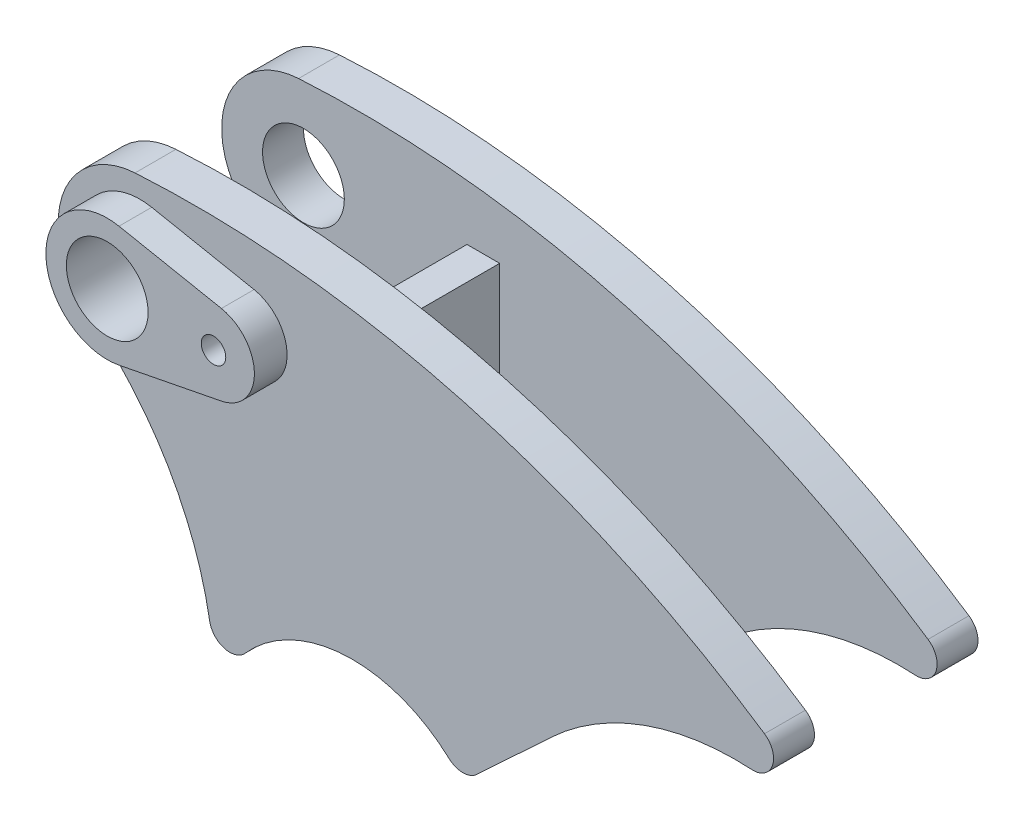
ISO-10303-21;
HEADER;
FILE_DESCRIPTION(('STEP AP214'),'2;1');
FILE_NAME('part.step','',(''),(''),'','','');
FILE_SCHEMA(('AUTOMOTIVE_DESIGN { 1 0 10303 214 1 1 1 1 }'));
ENDSEC;
DATA;
#1=APPLICATION_CONTEXT('core data for automotive mechanical design processes');
#2=APPLICATION_PROTOCOL_DEFINITION('international standard','automotive_design',2000,#1);
#3=PRODUCT_CONTEXT('',#1,'mechanical');
#4=PRODUCT('Part','Part','',(#3));
#5=PRODUCT_RELATED_PRODUCT_CATEGORY('part','',(#4));
#6=PRODUCT_DEFINITION_FORMATION('','',#4);
#7=PRODUCT_DEFINITION_CONTEXT('part definition',#1,'design');
#8=PRODUCT_DEFINITION('design','',#6,#7);
#9=PRODUCT_DEFINITION_SHAPE('','',#8);
#10=(LENGTH_UNIT() NAMED_UNIT(*) SI_UNIT(.MILLI.,.METRE.));
#11=(NAMED_UNIT(*) PLANE_ANGLE_UNIT() SI_UNIT($,.RADIAN.));
#12=(NAMED_UNIT(*) SI_UNIT($,.STERADIAN.) SOLID_ANGLE_UNIT());
#13=UNCERTAINTY_MEASURE_WITH_UNIT(LENGTH_MEASURE(1.E-05),#10,'distance_accuracy_value','');
#14=(GEOMETRIC_REPRESENTATION_CONTEXT(3) GLOBAL_UNCERTAINTY_ASSIGNED_CONTEXT((#13)) GLOBAL_UNIT_ASSIGNED_CONTEXT((#10,
#11,#12)) REPRESENTATION_CONTEXT('',''));
#15=CARTESIAN_POINT('',(0.,0.,0.));
#16=DIRECTION('',(0.,0.,1.));
#17=DIRECTION('',(1.,0.,0.));
#18=AXIS2_PLACEMENT_3D('',#15,#16,#17);
#19=CARTESIAN_POINT('',(51.9730544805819,-91.4880351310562,25.));
#20=DIRECTION('',(0.,0.,-1.));
#21=DIRECTION('',(-1.,0.,0.));
#22=AXIS2_PLACEMENT_3D('',#19,#20,#21);
#23=PLANE('',#22);
#24=CARTESIAN_POINT('',(51.9730544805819,-91.4880351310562,25.));
#25=DIRECTION('',(0.,0.,-1.));
#26=DIRECTION('',(-1.,0.,0.));
#27=AXIS2_PLACEMENT_3D('',#24,#25,#26);
#28=CIRCLE('',#27,35.);
#29=CARTESIAN_POINT('',(25.7466318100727,-68.311004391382,25.));
#30=VERTEX_POINT('',#29);
#31=CARTESIAN_POINT('',(75.6216318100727,-65.686004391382,25.));
#32=VERTEX_POINT('',#31);
#33=EDGE_CURVE('E335',#30,#32,#28,.T.);
#34=ORIENTED_EDGE('',*,*,#33,.T.);
#35=CARTESIAN_POINT('',(79.,-62.,25.));
#36=DIRECTION('',(0.,0.,1.));
#37=DIRECTION('',(1.,0.,0.));
#38=AXIS2_PLACEMENT_3D('',#35,#36,#37);
#39=CIRCLE('',#38,5.00000000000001);
#40=CARTESIAN_POINT('',(82.4099918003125,-65.6567685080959,25.));
#41=VERTEX_POINT('',#40);
#42=EDGE_CURVE('E338',#32,#41,#39,.T.);
#43=ORIENTED_EDGE('',*,*,#42,.T.);
#44=DIRECTION('',(0.731353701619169,0.6819983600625,0.));
#45=VECTOR('',#44,1.);
#46=CARTESIAN_POINT('',(82.4099918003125,-65.6567685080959,25.));
#47=LINE('',#46,#45);
#48=CARTESIAN_POINT('',(100.693834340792,-48.6068095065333,25.));
#49=VERTEX_POINT('',#48);
#50=EDGE_CURVE('E341',#41,#49,#47,.T.);
#51=ORIENTED_EDGE('',*,*,#50,.T.);
#52=CARTESIAN_POINT('',(145.705726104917,-96.8761538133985,25.));
#53=DIRECTION('',(0.,0.,-1.));
#54=DIRECTION('',(1.,0.,0.));
#55=AXIS2_PLACEMENT_3D('',#52,#53,#54);
#56=CIRCLE('',#55,66.);
#57=CARTESIAN_POINT('',(149.697586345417,-30.9969837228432,25.));
#58=VERTEX_POINT('',#57);
#59=EDGE_CURVE('E343',#49,#58,#56,.T.);
#60=ORIENTED_EDGE('',*,*,#59,.T.);
#61=CARTESIAN_POINT('',(150.,-26.0061375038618,25.));
#62=DIRECTION('',(0.,0.,1.));
#63=DIRECTION('',(1.,0.,0.));
#64=AXIS2_PLACEMENT_3D('',#61,#62,#63);
#65=CIRCLE('',#64,5.00000000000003);
#66=CARTESIAN_POINT('',(152.781650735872,-21.8513307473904,25.));
#67=VERTEX_POINT('',#66);
#68=EDGE_CURVE('E345',#58,#67,#65,.T.);
#69=ORIENTED_EDGE('',*,*,#68,.T.);
#70=CARTESIAN_POINT('',(13.6991139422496,-229.591668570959,25.));
#71=DIRECTION('',(0.,0.,1.));
#72=DIRECTION('',(-1.,0.,0.));
#73=AXIS2_PLACEMENT_3D('',#70,#71,#72);
#74=CIRCLE('',#73,250.);
#75=CARTESIAN_POINT('',(-1.19122729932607,19.964492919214,25.));
#76=VERTEX_POINT('',#75);
#77=EDGE_CURVE('E347',#67,#76,#74,.T.);
#78=ORIENTED_EDGE('',*,*,#77,.T.);
#79=CARTESIAN_POINT('',(0.,0.,25.));
#80=DIRECTION('',(0.,0.,1.));
#81=DIRECTION('',(1.,0.,0.));
#82=AXIS2_PLACEMENT_3D('',#79,#80,#81);
#83=CIRCLE('',#82,20.0000000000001);
#84=CARTESIAN_POINT('',(-12.5602355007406,-15.564076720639,25.));
#85=VERTEX_POINT('',#84);
#86=EDGE_CURVE('E349',#76,#85,#83,.T.);
#87=ORIENTED_EDGE('',*,*,#86,.T.);
#88=CARTESIAN_POINT('',(-64.6852128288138,-80.1549951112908,25.));
#89=DIRECTION('',(0.,0.,-1.));
#90=DIRECTION('',(-1.,0.,0.));
#91=AXIS2_PLACEMENT_3D('',#88,#89,#90);
#92=CIRCLE('',#91,83.);
#93=CARTESIAN_POINT('',(17.0747038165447,-65.861079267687,25.));
#94=VERTEX_POINT('',#93);
#95=EDGE_CURVE('E351',#85,#94,#92,.T.);
#96=ORIENTED_EDGE('',*,*,#95,.T.);
#97=CARTESIAN_POINT('',(22.,-65.,25.));
#98=DIRECTION('',(0.,0.,1.));
#99=DIRECTION('',(1.,0.,0.));
#100=AXIS2_PLACEMENT_3D('',#97,#98,#99);
#101=CIRCLE('',#100,5.);
#102=EDGE_CURVE('E353',#94,#30,#101,.T.);
#103=ORIENTED_EDGE('',*,*,#102,.T.);
#104=EDGE_LOOP('',(#34,#43,#51,#60,#69,#78,#87,#96,#103));
#105=FACE_BOUND('',#104,.T.);
#106=CARTESIAN_POINT('',(0.,0.,25.));
#107=DIRECTION('',(0.,0.,1.));
#108=DIRECTION('',(1.,0.,0.));
#109=AXIS2_PLACEMENT_3D('',#106,#107,#108);
#110=CIRCLE('',#109,15.);
#111=CARTESIAN_POINT('',(2.88461538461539,14.7200201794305,25.));
#112=VERTEX_POINT('',#111);
#113=CARTESIAN_POINT('',(2.88461538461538,-14.7200201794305,25.));
#114=VERTEX_POINT('',#113);
#115=EDGE_CURVE('E232',#112,#114,#110,.T.);
#116=ORIENTED_EDGE('',*,*,#115,.F.);
#117=DIRECTION('',(-0.981334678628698,0.192307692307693,0.));
#118=VECTOR('',#117,1.);
#119=CARTESIAN_POINT('',(2.88461538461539,14.7200201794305,25.));
#120=LINE('',#119,#118);
#121=CARTESIAN_POINT('',(27.9230769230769,9.81334678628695,25.));
#122=VERTEX_POINT('',#121);
#123=EDGE_CURVE('E229',#122,#112,#120,.T.);
#124=ORIENTED_EDGE('',*,*,#123,.F.);
#125=CARTESIAN_POINT('',(26.,0.,25.));
#126=DIRECTION('',(0.,0.,1.));
#127=DIRECTION('',(1.,0.,0.));
#128=AXIS2_PLACEMENT_3D('',#125,#126,#127);
#129=CIRCLE('',#128,10.);
#130=CARTESIAN_POINT('',(27.9230769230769,-9.81334678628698,25.));
#131=VERTEX_POINT('',#130);
#132=EDGE_CURVE('E59',#131,#122,#129,.T.);
#133=ORIENTED_EDGE('',*,*,#132,.F.);
#134=DIRECTION('',(0.981334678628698,0.192307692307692,0.));
#135=VECTOR('',#134,1.);
#136=CARTESIAN_POINT('',(2.88461538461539,-14.7200201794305,25.));
#137=LINE('',#136,#135);
#138=EDGE_CURVE('E54',#114,#131,#137,.T.);
#139=ORIENTED_EDGE('',*,*,#138,.F.);
#140=EDGE_LOOP('',(#116,#124,#133,#139));
#141=FACE_BOUND('',#140,.T.);
#142=ADVANCED_FACE('F39',(#105,#141),#23,.F.);
#143=CARTESIAN_POINT('',(51.9730544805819,-91.4880351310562,25.));
#144=DIRECTION('',(0.,0.,-1.));
#145=DIRECTION('',(-1.,0.,0.));
#146=AXIS2_PLACEMENT_3D('',#143,#144,#145);
#147=CYLINDRICAL_SURFACE('',#146,35.);
#148=CARTESIAN_POINT('',(51.9730544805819,-91.4880351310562,15.));
#149=DIRECTION('',(0.,0.,-1.));
#150=DIRECTION('',(-1.,0.,0.));
#151=AXIS2_PLACEMENT_3D('',#148,#149,#150);
#152=CIRCLE('',#151,35.);
#153=CARTESIAN_POINT('',(25.7466318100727,-68.311004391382,15.));
#154=VERTEX_POINT('',#153);
#155=CARTESIAN_POINT('',(75.6216318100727,-65.686004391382,15.));
#156=VERTEX_POINT('',#155);
#157=EDGE_CURVE('E334',#154,#156,#152,.T.);
#158=ORIENTED_EDGE('',*,*,#157,.T.);
#159=DIRECTION('',(0.,0.,-1.));
#160=VECTOR('',#159,1.);
#161=CARTESIAN_POINT('',(75.6216318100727,-65.686004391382,25.));
#162=LINE('',#161,#160);
#163=EDGE_CURVE('E396',#32,#156,#162,.T.);
#164=ORIENTED_EDGE('',*,*,#163,.F.);
#165=ORIENTED_EDGE('',*,*,#33,.F.);
#166=DIRECTION('',(0.,0.,-1.));
#167=VECTOR('',#166,1.);
#168=CARTESIAN_POINT('',(25.7466318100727,-68.311004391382,25.));
#169=LINE('',#168,#167);
#170=EDGE_CURVE('E355',#30,#154,#169,.T.);
#171=ORIENTED_EDGE('',*,*,#170,.T.);
#172=EDGE_LOOP('',(#158,#164,#165,#171));
#173=FACE_BOUND('',#172,.T.);
#174=ADVANCED_FACE('F41',(#173),#147,.F.);
#175=CARTESIAN_POINT('',(79.,-62.,25.));
#176=DIRECTION('',(0.,0.,-1.));
#177=DIRECTION('',(-1.,0.,0.));
#178=AXIS2_PLACEMENT_3D('',#175,#176,#177);
#179=CYLINDRICAL_SURFACE('',#178,5.00000000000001);
#180=CARTESIAN_POINT('',(79.,-62.,15.));
#181=DIRECTION('',(0.,0.,1.));
#182=DIRECTION('',(1.,0.,0.));
#183=AXIS2_PLACEMENT_3D('',#180,#181,#182);
#184=CIRCLE('',#183,5.00000000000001);
#185=CARTESIAN_POINT('',(82.4099918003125,-65.6567685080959,15.));
#186=VERTEX_POINT('',#185);
#187=EDGE_CURVE('E358',#156,#186,#184,.T.);
#188=ORIENTED_EDGE('',*,*,#187,.T.);
#189=DIRECTION('',(0.,0.,-1.));
#190=VECTOR('',#189,1.);
#191=CARTESIAN_POINT('',(82.4099918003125,-65.6567685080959,25.));
#192=LINE('',#191,#190);
#193=EDGE_CURVE('E393',#41,#186,#192,.T.);
#194=ORIENTED_EDGE('',*,*,#193,.F.);
#195=ORIENTED_EDGE('',*,*,#42,.F.);
#196=ORIENTED_EDGE('',*,*,#163,.T.);
#197=EDGE_LOOP('',(#188,#194,#195,#196));
#198=FACE_BOUND('',#197,.T.);
#199=ADVANCED_FACE('F443',(#198),#179,.T.);
#200=CARTESIAN_POINT('',(82.4099918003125,-65.6567685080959,25.));
#201=DIRECTION('',(-0.6819983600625,0.731353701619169,0.));
#202=DIRECTION('',(-0.731353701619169,-0.6819983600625,0.));
#203=AXIS2_PLACEMENT_3D('',#200,#201,#202);
#204=PLANE('',#203);
#205=DIRECTION('',(0.731353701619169,0.6819983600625,0.));
#206=VECTOR('',#205,1.);
#207=CARTESIAN_POINT('',(82.4099918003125,-65.6567685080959,15.));
#208=LINE('',#207,#206);
#209=CARTESIAN_POINT('',(100.693834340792,-48.6068095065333,15.));
#210=VERTEX_POINT('',#209);
#211=EDGE_CURVE('E360',#186,#210,#208,.T.);
#212=ORIENTED_EDGE('',*,*,#211,.T.);
#213=DIRECTION('',(0.,0.,-1.));
#214=VECTOR('',#213,1.);
#215=CARTESIAN_POINT('',(100.693834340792,-48.6068095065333,25.));
#216=LINE('',#215,#214);
#217=EDGE_CURVE('E390',#49,#210,#216,.T.);
#218=ORIENTED_EDGE('',*,*,#217,.F.);
#219=ORIENTED_EDGE('',*,*,#50,.F.);
#220=ORIENTED_EDGE('',*,*,#193,.T.);
#221=EDGE_LOOP('',(#212,#218,#219,#220));
#222=FACE_BOUND('',#221,.T.);
#223=ADVANCED_FACE('F472',(#222),#204,.F.);
#224=CARTESIAN_POINT('',(145.705726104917,-96.8761538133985,25.));
#225=DIRECTION('',(0.,0.,-1.));
#226=DIRECTION('',(-1.,0.,0.));
#227=AXIS2_PLACEMENT_3D('',#224,#225,#226);
#228=CYLINDRICAL_SURFACE('',#227,66.);
#229=CARTESIAN_POINT('',(145.705726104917,-96.8761538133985,15.));
#230=DIRECTION('',(0.,0.,-1.));
#231=DIRECTION('',(1.,0.,0.));
#232=AXIS2_PLACEMENT_3D('',#229,#230,#231);
#233=CIRCLE('',#232,66.);
#234=CARTESIAN_POINT('',(149.697586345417,-30.9969837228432,15.));
#235=VERTEX_POINT('',#234);
#236=EDGE_CURVE('E362',#210,#235,#233,.T.);
#237=ORIENTED_EDGE('',*,*,#236,.T.);
#238=DIRECTION('',(0.,0.,-1.));
#239=VECTOR('',#238,1.);
#240=CARTESIAN_POINT('',(149.697586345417,-30.9969837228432,25.));
#241=LINE('',#240,#239);
#242=EDGE_CURVE('E387',#58,#235,#241,.T.);
#243=ORIENTED_EDGE('',*,*,#242,.F.);
#244=ORIENTED_EDGE('',*,*,#59,.F.);
#245=ORIENTED_EDGE('',*,*,#217,.T.);
#246=EDGE_LOOP('',(#237,#243,#244,#245));
#247=FACE_BOUND('',#246,.T.);
#248=ADVANCED_FACE('F468',(#247),#228,.F.);
#249=CARTESIAN_POINT('',(150.,-26.0061375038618,25.));
#250=DIRECTION('',(0.,0.,-1.));
#251=DIRECTION('',(-1.,0.,0.));
#252=AXIS2_PLACEMENT_3D('',#249,#250,#251);
#253=CYLINDRICAL_SURFACE('',#252,5.00000000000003);
#254=CARTESIAN_POINT('',(150.,-26.0061375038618,15.));
#255=DIRECTION('',(0.,0.,1.));
#256=DIRECTION('',(1.,0.,0.));
#257=AXIS2_PLACEMENT_3D('',#254,#255,#256);
#258=CIRCLE('',#257,5.00000000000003);
#259=CARTESIAN_POINT('',(152.781650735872,-21.8513307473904,15.));
#260=VERTEX_POINT('',#259);
#261=EDGE_CURVE('E364',#235,#260,#258,.T.);
#262=ORIENTED_EDGE('',*,*,#261,.T.);
#263=DIRECTION('',(0.,0.,-1.));
#264=VECTOR('',#263,1.);
#265=CARTESIAN_POINT('',(152.781650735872,-21.8513307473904,25.));
#266=LINE('',#265,#264);
#267=EDGE_CURVE('E384',#67,#260,#266,.T.);
#268=ORIENTED_EDGE('',*,*,#267,.F.);
#269=ORIENTED_EDGE('',*,*,#68,.F.);
#270=ORIENTED_EDGE('',*,*,#242,.T.);
#271=EDGE_LOOP('',(#262,#268,#269,#270));
#272=FACE_BOUND('',#271,.T.);
#273=ADVANCED_FACE('F464',(#272),#253,.T.);
#274=CARTESIAN_POINT('',(13.6991139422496,-229.591668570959,25.));
#275=DIRECTION('',(0.,0.,-1.));
#276=DIRECTION('',(-1.,0.,0.));
#277=AXIS2_PLACEMENT_3D('',#274,#275,#276);
#278=CYLINDRICAL_SURFACE('',#277,250.);
#279=CARTESIAN_POINT('',(13.6991139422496,-229.591668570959,15.));
#280=DIRECTION('',(0.,0.,1.));
#281=DIRECTION('',(-1.,0.,0.));
#282=AXIS2_PLACEMENT_3D('',#279,#280,#281);
#283=CIRCLE('',#282,250.);
#284=CARTESIAN_POINT('',(-1.19122729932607,19.964492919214,15.));
#285=VERTEX_POINT('',#284);
#286=EDGE_CURVE('E366',#260,#285,#283,.T.);
#287=ORIENTED_EDGE('',*,*,#286,.T.);
#288=DIRECTION('',(0.,0.,-1.));
#289=VECTOR('',#288,1.);
#290=CARTESIAN_POINT('',(-1.19122729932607,19.964492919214,25.));
#291=LINE('',#290,#289);
#292=EDGE_CURVE('E381',#76,#285,#291,.T.);
#293=ORIENTED_EDGE('',*,*,#292,.F.);
#294=ORIENTED_EDGE('',*,*,#77,.F.);
#295=ORIENTED_EDGE('',*,*,#267,.T.);
#296=EDGE_LOOP('',(#287,#293,#294,#295));
#297=FACE_BOUND('',#296,.T.);
#298=ADVANCED_FACE('F460',(#297),#278,.T.);
#299=CARTESIAN_POINT('',(0.,0.,25.));
#300=DIRECTION('',(0.,0.,-1.));
#301=DIRECTION('',(-1.,0.,0.));
#302=AXIS2_PLACEMENT_3D('',#299,#300,#301);
#303=CYLINDRICAL_SURFACE('',#302,20.0000000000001);
#304=CARTESIAN_POINT('',(0.,0.,15.));
#305=DIRECTION('',(0.,0.,1.));
#306=DIRECTION('',(1.,0.,0.));
#307=AXIS2_PLACEMENT_3D('',#304,#305,#306);
#308=CIRCLE('',#307,20.0000000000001);
#309=CARTESIAN_POINT('',(-12.5602355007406,-15.564076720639,15.));
#310=VERTEX_POINT('',#309);
#311=EDGE_CURVE('E368',#285,#310,#308,.T.);
#312=ORIENTED_EDGE('',*,*,#311,.T.);
#313=DIRECTION('',(0.,0.,-1.));
#314=VECTOR('',#313,1.);
#315=CARTESIAN_POINT('',(-12.5602355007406,-15.564076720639,25.));
#316=LINE('',#315,#314);
#317=EDGE_CURVE('E378',#85,#310,#316,.T.);
#318=ORIENTED_EDGE('',*,*,#317,.F.);
#319=ORIENTED_EDGE('',*,*,#86,.F.);
#320=ORIENTED_EDGE('',*,*,#292,.T.);
#321=EDGE_LOOP('',(#312,#318,#319,#320));
#322=FACE_BOUND('',#321,.T.);
#323=ADVANCED_FACE('F456',(#322),#303,.T.);
#324=CARTESIAN_POINT('',(-64.6852128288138,-80.1549951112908,25.));
#325=DIRECTION('',(0.,0.,-1.));
#326=DIRECTION('',(-1.,0.,0.));
#327=AXIS2_PLACEMENT_3D('',#324,#325,#326);
#328=CYLINDRICAL_SURFACE('',#327,83.);
#329=CARTESIAN_POINT('',(-64.6852128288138,-80.1549951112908,15.));
#330=DIRECTION('',(0.,0.,-1.));
#331=DIRECTION('',(-1.,0.,0.));
#332=AXIS2_PLACEMENT_3D('',#329,#330,#331);
#333=CIRCLE('',#332,83.);
#334=CARTESIAN_POINT('',(17.0747038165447,-65.861079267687,15.));
#335=VERTEX_POINT('',#334);
#336=EDGE_CURVE('E370',#310,#335,#333,.T.);
#337=ORIENTED_EDGE('',*,*,#336,.T.);
#338=DIRECTION('',(0.,0.,-1.));
#339=VECTOR('',#338,1.);
#340=CARTESIAN_POINT('',(17.0747038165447,-65.861079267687,25.));
#341=LINE('',#340,#339);
#342=EDGE_CURVE('E375',#94,#335,#341,.T.);
#343=ORIENTED_EDGE('',*,*,#342,.F.);
#344=ORIENTED_EDGE('',*,*,#95,.F.);
#345=ORIENTED_EDGE('',*,*,#317,.T.);
#346=EDGE_LOOP('',(#337,#343,#344,#345));
#347=FACE_BOUND('',#346,.T.);
#348=ADVANCED_FACE('F452',(#347),#328,.F.);
#349=CARTESIAN_POINT('',(22.,-65.,25.));
#350=DIRECTION('',(0.,0.,-1.));
#351=DIRECTION('',(-1.,0.,0.));
#352=AXIS2_PLACEMENT_3D('',#349,#350,#351);
#353=CYLINDRICAL_SURFACE('',#352,5.);
#354=CARTESIAN_POINT('',(22.,-65.,15.));
#355=DIRECTION('',(0.,0.,1.));
#356=DIRECTION('',(1.,0.,0.));
#357=AXIS2_PLACEMENT_3D('',#354,#355,#356);
#358=CIRCLE('',#357,5.);
#359=EDGE_CURVE('E339',#335,#154,#358,.T.);
#360=ORIENTED_EDGE('',*,*,#359,.T.);
#361=ORIENTED_EDGE('',*,*,#170,.F.);
#362=ORIENTED_EDGE('',*,*,#102,.F.);
#363=ORIENTED_EDGE('',*,*,#342,.T.);
#364=EDGE_LOOP('',(#360,#361,#362,#363));
#365=FACE_BOUND('',#364,.T.);
#366=ADVANCED_FACE('F448',(#365),#353,.T.);
#367=CARTESIAN_POINT('',(51.9730544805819,-91.4880351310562,15.));
#368=DIRECTION('',(0.,0.,-1.));
#369=DIRECTION('',(-1.,0.,0.));
#370=AXIS2_PLACEMENT_3D('',#367,#368,#369);
#371=PLANE('',#370);
#372=CARTESIAN_POINT('',(26.,0.,15.));
#373=DIRECTION('',(0.,0.,-1.));
#374=DIRECTION('',(-1.,0.,0.));
#375=AXIS2_PLACEMENT_3D('',#372,#373,#374);
#376=CIRCLE('',#375,3.);
#377=CARTESIAN_POINT('',(23.,0.,15.));
#378=VERTEX_POINT('',#377);
#379=EDGE_CURVE('E743',#378,#378,#376,.T.);
#380=ORIENTED_EDGE('',*,*,#379,.F.);
#381=EDGE_LOOP('',(#380));
#382=FACE_BOUND('',#381,.T.);
#383=CARTESIAN_POINT('',(0.,0.,15.));
#384=DIRECTION('',(0.,0.,-1.));
#385=DIRECTION('',(-1.,0.,0.));
#386=AXIS2_PLACEMENT_3D('',#383,#384,#385);
#387=CIRCLE('',#386,10.);
#388=CARTESIAN_POINT('',(10.,0.,15.));
#389=VERTEX_POINT('',#388);
#390=EDGE_CURVE('E722',#389,#389,#387,.T.);
#391=ORIENTED_EDGE('',*,*,#390,.F.);
#392=EDGE_LOOP('',(#391));
#393=FACE_BOUND('',#392,.T.);
#394=DIRECTION('',(0.,1.,0.));
#395=VECTOR('',#394,1.);
#396=CARTESIAN_POINT('',(40.,-91.4880351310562,15.));
#397=LINE('',#396,#395);
#398=CARTESIAN_POINT('',(40.,-34.5916685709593,15.));
#399=VERTEX_POINT('',#398);
#400=CARTESIAN_POINT('',(40.,5.40833142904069,15.));
#401=VERTEX_POINT('',#400);
#402=EDGE_CURVE('E11',#399,#401,#397,.T.);
#403=ORIENTED_EDGE('',*,*,#402,.F.);
#404=DIRECTION('',(-1.,0.,0.));
#405=VECTOR('',#404,1.);
#406=CARTESIAN_POINT('',(51.9730544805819,-34.5916685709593,15.));
#407=LINE('',#406,#405);
#408=CARTESIAN_POINT('',(48.,-34.5916685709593,15.));
#409=VERTEX_POINT('',#408);
#410=EDGE_CURVE('E399',#409,#399,#407,.T.);
#411=ORIENTED_EDGE('',*,*,#410,.F.);
#412=DIRECTION('',(0.,-1.,0.));
#413=VECTOR('',#412,1.);
#414=CARTESIAN_POINT('',(48.,-91.4880351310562,15.));
#415=LINE('',#414,#413);
#416=CARTESIAN_POINT('',(48.,5.40833142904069,15.));
#417=VERTEX_POINT('',#416);
#418=EDGE_CURVE('E402',#417,#409,#415,.T.);
#419=ORIENTED_EDGE('',*,*,#418,.F.);
#420=DIRECTION('',(1.,0.,0.));
#421=VECTOR('',#420,1.);
#422=CARTESIAN_POINT('',(51.9730544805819,5.40833142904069,15.));
#423=LINE('',#422,#421);
#424=EDGE_CURVE('E47',#401,#417,#423,.T.);
#425=ORIENTED_EDGE('',*,*,#424,.F.);
#426=EDGE_LOOP('',(#403,#411,#419,#425));
#427=FACE_BOUND('',#426,.T.);
#428=ORIENTED_EDGE('',*,*,#157,.F.);
#429=ORIENTED_EDGE('',*,*,#359,.F.);
#430=ORIENTED_EDGE('',*,*,#336,.F.);
#431=ORIENTED_EDGE('',*,*,#311,.F.);
#432=ORIENTED_EDGE('',*,*,#286,.F.);
#433=ORIENTED_EDGE('',*,*,#261,.F.);
#434=ORIENTED_EDGE('',*,*,#236,.F.);
#435=ORIENTED_EDGE('',*,*,#211,.F.);
#436=ORIENTED_EDGE('',*,*,#187,.F.);
#437=EDGE_LOOP('',(#428,#429,#430,#431,#432,#433,#434,#435,#436));
#438=FACE_BOUND('',#437,.T.);
#439=ADVANCED_FACE('F419',(#382,#393,#427,#438),#371,.T.);
#440=CARTESIAN_POINT('',(40.,5.40833142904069,-55.7921561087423));
#441=DIRECTION('',(-1.,0.,0.));
#442=DIRECTION('',(0.,-1.,0.));
#443=AXIS2_PLACEMENT_3D('',#440,#441,#442);
#444=PLANE('',#443);
#445=DIRECTION('',(0.,0.,1.));
#446=VECTOR('',#445,1.);
#447=CARTESIAN_POINT('',(40.,-34.5916685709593,-55.7921561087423));
#448=LINE('',#447,#446);
#449=CARTESIAN_POINT('',(40.,-34.5916685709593,-15.));
#450=VERTEX_POINT('',#449);
#451=EDGE_CURVE('E295',#450,#399,#448,.T.);
#452=ORIENTED_EDGE('',*,*,#451,.T.);
#453=ORIENTED_EDGE('',*,*,#402,.T.);
#454=DIRECTION('',(0.,0.,1.));
#455=VECTOR('',#454,1.);
#456=CARTESIAN_POINT('',(40.,5.40833142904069,-55.7921561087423));
#457=LINE('',#456,#455);
#458=CARTESIAN_POINT('',(40.,5.40833142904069,-15.));
#459=VERTEX_POINT('',#458);
#460=EDGE_CURVE('E315',#459,#401,#457,.T.);
#461=ORIENTED_EDGE('',*,*,#460,.F.);
#462=DIRECTION('',(0.,1.,0.));
#463=VECTOR('',#462,1.);
#464=CARTESIAN_POINT('',(40.,5.40833142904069,-15.));
#465=LINE('',#464,#463);
#466=EDGE_CURVE('E318',#450,#459,#465,.T.);
#467=ORIENTED_EDGE('',*,*,#466,.F.);
#468=EDGE_LOOP('',(#452,#453,#461,#467));
#469=FACE_BOUND('',#468,.T.);
#470=ADVANCED_FACE('F418',(#469),#444,.T.);
#471=CARTESIAN_POINT('',(40.,5.40833142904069,-55.7921561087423));
#472=DIRECTION('',(0.,1.,0.));
#473=DIRECTION('',(0.,0.,1.));
#474=AXIS2_PLACEMENT_3D('',#471,#472,#473);
#475=PLANE('',#474);
#476=ORIENTED_EDGE('',*,*,#460,.T.);
#477=ORIENTED_EDGE('',*,*,#424,.T.);
#478=DIRECTION('',(0.,0.,1.));
#479=VECTOR('',#478,1.);
#480=CARTESIAN_POINT('',(48.,5.40833142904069,-55.7921561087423));
#481=LINE('',#480,#479);
#482=CARTESIAN_POINT('',(48.,5.40833142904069,-15.));
#483=VERTEX_POINT('',#482);
#484=EDGE_CURVE('E324',#483,#417,#481,.T.);
#485=ORIENTED_EDGE('',*,*,#484,.F.);
#486=DIRECTION('',(1.,0.,0.));
#487=VECTOR('',#486,1.);
#488=CARTESIAN_POINT('',(40.,5.40833142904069,-15.));
#489=LINE('',#488,#487);
#490=EDGE_CURVE('E314',#459,#483,#489,.T.);
#491=ORIENTED_EDGE('',*,*,#490,.F.);
#492=EDGE_LOOP('',(#476,#477,#485,#491));
#493=FACE_BOUND('',#492,.T.);
#494=ADVANCED_FACE('F407',(#493),#475,.T.);
#495=CARTESIAN_POINT('',(48.,5.40833142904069,-55.7921561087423));
#496=DIRECTION('',(1.,0.,0.));
#497=DIRECTION('',(0.,1.,0.));
#498=AXIS2_PLACEMENT_3D('',#495,#496,#497);
#499=PLANE('',#498);
#500=ORIENTED_EDGE('',*,*,#484,.T.);
#501=ORIENTED_EDGE('',*,*,#418,.T.);
#502=DIRECTION('',(0.,0.,1.));
#503=VECTOR('',#502,1.);
#504=CARTESIAN_POINT('',(48.,-34.5916685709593,-55.7921561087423));
#505=LINE('',#504,#503);
#506=CARTESIAN_POINT('',(48.,-34.5916685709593,-15.));
#507=VERTEX_POINT('',#506);
#508=EDGE_CURVE('E327',#507,#409,#505,.T.);
#509=ORIENTED_EDGE('',*,*,#508,.F.);
#510=DIRECTION('',(0.,-1.,0.));
#511=VECTOR('',#510,1.);
#512=CARTESIAN_POINT('',(48.,5.40833142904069,-15.));
#513=LINE('',#512,#511);
#514=EDGE_CURVE('E311',#483,#507,#513,.T.);
#515=ORIENTED_EDGE('',*,*,#514,.F.);
#516=EDGE_LOOP('',(#500,#501,#509,#515));
#517=FACE_BOUND('',#516,.T.);
#518=ADVANCED_FACE('F411',(#517),#499,.T.);
#519=CARTESIAN_POINT('',(40.,-34.5916685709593,-55.7921561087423));
#520=DIRECTION('',(0.,-1.,0.));
#521=DIRECTION('',(0.,0.,-1.));
#522=AXIS2_PLACEMENT_3D('',#519,#520,#521);
#523=PLANE('',#522);
#524=ORIENTED_EDGE('',*,*,#508,.T.);
#525=ORIENTED_EDGE('',*,*,#410,.T.);
#526=ORIENTED_EDGE('',*,*,#451,.F.);
#527=DIRECTION('',(-1.,0.,0.));
#528=VECTOR('',#527,1.);
#529=CARTESIAN_POINT('',(40.,-34.5916685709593,-15.));
#530=LINE('',#529,#528);
#531=EDGE_CURVE('E321',#507,#450,#530,.T.);
#532=ORIENTED_EDGE('',*,*,#531,.F.);
#533=EDGE_LOOP('',(#524,#525,#526,#532));
#534=FACE_BOUND('',#533,.T.);
#535=ADVANCED_FACE('F422',(#534),#523,.T.);
#536=CARTESIAN_POINT('',(79.,-62.,-25.));
#537=DIRECTION('',(0.,0.,1.));
#538=DIRECTION('',(1.,0.,0.));
#539=AXIS2_PLACEMENT_3D('',#536,#537,#538);
#540=CYLINDRICAL_SURFACE('',#539,5.00000000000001);
#541=CARTESIAN_POINT('',(79.,-62.,-15.));
#542=DIRECTION('',(0.,0.,1.));
#543=DIRECTION('',(1.,0.,0.));
#544=AXIS2_PLACEMENT_3D('',#541,#542,#543);
#545=CIRCLE('',#544,5.00000000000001);
#546=CARTESIAN_POINT('',(75.6216318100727,-65.686004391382,-15.));
#547=VERTEX_POINT('',#546);
#548=CARTESIAN_POINT('',(82.4099918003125,-65.6567685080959,-15.));
#549=VERTEX_POINT('',#548);
#550=EDGE_CURVE('E233',#547,#549,#545,.T.);
#551=ORIENTED_EDGE('',*,*,#550,.F.);
#552=DIRECTION('',(0.,0.,1.));
#553=VECTOR('',#552,1.);
#554=CARTESIAN_POINT('',(75.6216318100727,-65.686004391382,-25.));
#555=LINE('',#554,#553);
#556=CARTESIAN_POINT('',(75.6216318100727,-65.686004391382,-25.));
#557=VERTEX_POINT('',#556);
#558=EDGE_CURVE('E293',#557,#547,#555,.T.);
#559=ORIENTED_EDGE('',*,*,#558,.F.);
#560=CARTESIAN_POINT('',(79.,-62.,-25.));
#561=DIRECTION('',(0.,0.,1.));
#562=DIRECTION('',(1.,0.,0.));
#563=AXIS2_PLACEMENT_3D('',#560,#561,#562);
#564=CIRCLE('',#563,5.00000000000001);
#565=CARTESIAN_POINT('',(82.4099918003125,-65.6567685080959,-25.));
#566=VERTEX_POINT('',#565);
#567=EDGE_CURVE('E242',#557,#566,#564,.T.);
#568=ORIENTED_EDGE('',*,*,#567,.T.);
#569=DIRECTION('',(0.,0.,1.));
#570=VECTOR('',#569,1.);
#571=CARTESIAN_POINT('',(82.4099918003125,-65.6567685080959,-25.));
#572=LINE('',#571,#570);
#573=EDGE_CURVE('E269',#566,#549,#572,.T.);
#574=ORIENTED_EDGE('',*,*,#573,.T.);
#575=EDGE_LOOP('',(#551,#559,#568,#574));
#576=FACE_BOUND('',#575,.T.);
#577=ADVANCED_FACE('F424',(#576),#540,.T.);
#578=CARTESIAN_POINT('',(51.9730544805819,-91.4880351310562,-25.));
#579=DIRECTION('',(0.,0.,1.));
#580=DIRECTION('',(1.,0.,0.));
#581=AXIS2_PLACEMENT_3D('',#578,#579,#580);
#582=CYLINDRICAL_SURFACE('',#581,35.);
#583=CARTESIAN_POINT('',(51.9730544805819,-91.4880351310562,-15.));
#584=DIRECTION('',(0.,0.,-1.));
#585=DIRECTION('',(1.,0.,0.));
#586=AXIS2_PLACEMENT_3D('',#583,#584,#585);
#587=CIRCLE('',#586,35.);
#588=CARTESIAN_POINT('',(25.7466318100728,-68.311004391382,-15.));
#589=VERTEX_POINT('',#588);
#590=EDGE_CURVE('E246',#589,#547,#587,.T.);
#591=ORIENTED_EDGE('',*,*,#590,.F.);
#592=DIRECTION('',(0.,0.,1.));
#593=VECTOR('',#592,1.);
#594=CARTESIAN_POINT('',(25.7466318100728,-68.311004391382,-25.));
#595=LINE('',#594,#593);
#596=CARTESIAN_POINT('',(25.7466318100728,-68.311004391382,-25.));
#597=VERTEX_POINT('',#596);
#598=EDGE_CURVE('E296',#597,#589,#595,.T.);
#599=ORIENTED_EDGE('',*,*,#598,.F.);
#600=CARTESIAN_POINT('',(51.9730544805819,-91.4880351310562,-25.));
#601=DIRECTION('',(0.,0.,-1.));
#602=DIRECTION('',(1.,0.,0.));
#603=AXIS2_PLACEMENT_3D('',#600,#601,#602);
#604=CIRCLE('',#603,35.);
#605=EDGE_CURVE('E267',#597,#557,#604,.T.);
#606=ORIENTED_EDGE('',*,*,#605,.T.);
#607=ORIENTED_EDGE('',*,*,#558,.T.);
#608=EDGE_LOOP('',(#591,#599,#606,#607));
#609=FACE_BOUND('',#608,.T.);
#610=ADVANCED_FACE('F430',(#609),#582,.F.);
#611=CARTESIAN_POINT('',(22.,-65.,-25.));
#612=DIRECTION('',(0.,0.,1.));
#613=DIRECTION('',(1.,0.,0.));
#614=AXIS2_PLACEMENT_3D('',#611,#612,#613);
#615=CYLINDRICAL_SURFACE('',#614,5.00000000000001);
#616=CARTESIAN_POINT('',(22.,-65.,-15.));
#617=DIRECTION('',(0.,0.,1.));
#618=DIRECTION('',(1.,0.,0.));
#619=AXIS2_PLACEMENT_3D('',#616,#617,#618);
#620=CIRCLE('',#619,5.00000000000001);
#621=CARTESIAN_POINT('',(17.0747038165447,-65.861079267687,-15.));
#622=VERTEX_POINT('',#621);
#623=EDGE_CURVE('E288',#622,#589,#620,.T.);
#624=ORIENTED_EDGE('',*,*,#623,.F.);
#625=DIRECTION('',(0.,0.,1.));
#626=VECTOR('',#625,1.);
#627=CARTESIAN_POINT('',(17.0747038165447,-65.861079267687,-25.));
#628=LINE('',#627,#626);
#629=CARTESIAN_POINT('',(17.0747038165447,-65.861079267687,-25.));
#630=VERTEX_POINT('',#629);
#631=EDGE_CURVE('E298',#630,#622,#628,.T.);
#632=ORIENTED_EDGE('',*,*,#631,.F.);
#633=CARTESIAN_POINT('',(22.,-65.,-25.));
#634=DIRECTION('',(0.,0.,1.));
#635=DIRECTION('',(1.,0.,0.));
#636=AXIS2_PLACEMENT_3D('',#633,#634,#635);
#637=CIRCLE('',#636,5.00000000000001);
#638=EDGE_CURVE('E264',#630,#597,#637,.T.);
#639=ORIENTED_EDGE('',*,*,#638,.T.);
#640=ORIENTED_EDGE('',*,*,#598,.T.);
#641=EDGE_LOOP('',(#624,#632,#639,#640));
#642=FACE_BOUND('',#641,.T.);
#643=ADVANCED_FACE('F628',(#642),#615,.T.);
#644=CARTESIAN_POINT('',(-64.6852128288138,-80.1549951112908,-25.));
#645=DIRECTION('',(0.,0.,1.));
#646=DIRECTION('',(1.,0.,0.));
#647=AXIS2_PLACEMENT_3D('',#644,#645,#646);
#648=CYLINDRICAL_SURFACE('',#647,83.);
#649=CARTESIAN_POINT('',(-64.6852128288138,-80.1549951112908,-15.));
#650=DIRECTION('',(0.,0.,-1.));
#651=DIRECTION('',(1.,0.,0.));
#652=AXIS2_PLACEMENT_3D('',#649,#650,#651);
#653=CIRCLE('',#652,83.);
#654=CARTESIAN_POINT('',(-12.5602355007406,-15.564076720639,-15.));
#655=VERTEX_POINT('',#654);
#656=EDGE_CURVE('E285',#655,#622,#653,.T.);
#657=ORIENTED_EDGE('',*,*,#656,.F.);
#658=DIRECTION('',(0.,0.,1.));
#659=VECTOR('',#658,1.);
#660=CARTESIAN_POINT('',(-12.5602355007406,-15.564076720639,-25.));
#661=LINE('',#660,#659);
#662=CARTESIAN_POINT('',(-12.5602355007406,-15.564076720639,-25.));
#663=VERTEX_POINT('',#662);
#664=EDGE_CURVE('E300',#663,#655,#661,.T.);
#665=ORIENTED_EDGE('',*,*,#664,.F.);
#666=CARTESIAN_POINT('',(-64.6852128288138,-80.1549951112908,-25.));
#667=DIRECTION('',(0.,0.,-1.));
#668=DIRECTION('',(1.,0.,0.));
#669=AXIS2_PLACEMENT_3D('',#666,#667,#668);
#670=CIRCLE('',#669,83.);
#671=EDGE_CURVE('E261',#663,#630,#670,.T.);
#672=ORIENTED_EDGE('',*,*,#671,.T.);
#673=ORIENTED_EDGE('',*,*,#631,.T.);
#674=EDGE_LOOP('',(#657,#665,#672,#673));
#675=FACE_BOUND('',#674,.T.);
#676=ADVANCED_FACE('F632',(#675),#648,.F.);
#677=CARTESIAN_POINT('',(0.,0.,-25.));
#678=DIRECTION('',(0.,0.,1.));
#679=DIRECTION('',(1.,0.,0.));
#680=AXIS2_PLACEMENT_3D('',#677,#678,#679);
#681=CYLINDRICAL_SURFACE('',#680,20.);
#682=CARTESIAN_POINT('',(0.,0.,-15.));
#683=DIRECTION('',(0.,0.,1.));
#684=DIRECTION('',(1.,0.,0.));
#685=AXIS2_PLACEMENT_3D('',#682,#683,#684);
#686=CIRCLE('',#685,20.);
#687=CARTESIAN_POINT('',(-1.19122729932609,19.964492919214,-15.));
#688=VERTEX_POINT('',#687);
#689=EDGE_CURVE('E282',#688,#655,#686,.T.);
#690=ORIENTED_EDGE('',*,*,#689,.F.);
#691=DIRECTION('',(0.,0.,1.));
#692=VECTOR('',#691,1.);
#693=CARTESIAN_POINT('',(-1.19122729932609,19.964492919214,-25.));
#694=LINE('',#693,#692);
#695=CARTESIAN_POINT('',(-1.19122729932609,19.964492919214,-25.));
#696=VERTEX_POINT('',#695);
#697=EDGE_CURVE('E302',#696,#688,#694,.T.);
#698=ORIENTED_EDGE('',*,*,#697,.F.);
#699=CARTESIAN_POINT('',(0.,0.,-25.));
#700=DIRECTION('',(0.,0.,1.));
#701=DIRECTION('',(1.,0.,0.));
#702=AXIS2_PLACEMENT_3D('',#699,#700,#701);
#703=CIRCLE('',#702,20.);
#704=EDGE_CURVE('E258',#696,#663,#703,.T.);
#705=ORIENTED_EDGE('',*,*,#704,.T.);
#706=ORIENTED_EDGE('',*,*,#664,.T.);
#707=EDGE_LOOP('',(#690,#698,#705,#706));
#708=FACE_BOUND('',#707,.T.);
#709=ADVANCED_FACE('F636',(#708),#681,.T.);
#710=CARTESIAN_POINT('',(13.6991139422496,-229.591668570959,-25.));
#711=DIRECTION('',(0.,0.,1.));
#712=DIRECTION('',(1.,0.,0.));
#713=AXIS2_PLACEMENT_3D('',#710,#711,#712);
#714=CYLINDRICAL_SURFACE('',#713,250.);
#715=CARTESIAN_POINT('',(13.6991139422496,-229.591668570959,-15.));
#716=DIRECTION('',(0.,0.,1.));
#717=DIRECTION('',(1.,0.,0.));
#718=AXIS2_PLACEMENT_3D('',#715,#716,#717);
#719=CIRCLE('',#718,250.);
#720=CARTESIAN_POINT('',(152.781650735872,-21.8513307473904,-15.));
#721=VERTEX_POINT('',#720);
#722=EDGE_CURVE('E279',#721,#688,#719,.T.);
#723=ORIENTED_EDGE('',*,*,#722,.F.);
#724=DIRECTION('',(0.,0.,1.));
#725=VECTOR('',#724,1.);
#726=CARTESIAN_POINT('',(152.781650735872,-21.8513307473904,-25.));
#727=LINE('',#726,#725);
#728=CARTESIAN_POINT('',(152.781650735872,-21.8513307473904,-25.));
#729=VERTEX_POINT('',#728);
#730=EDGE_CURVE('E304',#729,#721,#727,.T.);
#731=ORIENTED_EDGE('',*,*,#730,.F.);
#732=CARTESIAN_POINT('',(13.6991139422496,-229.591668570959,-25.));
#733=DIRECTION('',(0.,0.,1.));
#734=DIRECTION('',(1.,0.,0.));
#735=AXIS2_PLACEMENT_3D('',#732,#733,#734);
#736=CIRCLE('',#735,250.);
#737=EDGE_CURVE('E255',#729,#696,#736,.T.);
#738=ORIENTED_EDGE('',*,*,#737,.T.);
#739=ORIENTED_EDGE('',*,*,#697,.T.);
#740=EDGE_LOOP('',(#723,#731,#738,#739));
#741=FACE_BOUND('',#740,.T.);
#742=ADVANCED_FACE('F640',(#741),#714,.T.);
#743=CARTESIAN_POINT('',(150.,-26.0061375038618,-25.));
#744=DIRECTION('',(0.,0.,1.));
#745=DIRECTION('',(1.,0.,0.));
#746=AXIS2_PLACEMENT_3D('',#743,#744,#745);
#747=CYLINDRICAL_SURFACE('',#746,5.00000000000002);
#748=CARTESIAN_POINT('',(150.,-26.0061375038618,-15.));
#749=DIRECTION('',(0.,0.,1.));
#750=DIRECTION('',(1.,0.,0.));
#751=AXIS2_PLACEMENT_3D('',#748,#749,#750);
#752=CIRCLE('',#751,5.00000000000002);
#753=CARTESIAN_POINT('',(149.697586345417,-30.9969837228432,-15.));
#754=VERTEX_POINT('',#753);
#755=EDGE_CURVE('E276',#754,#721,#752,.T.);
#756=ORIENTED_EDGE('',*,*,#755,.F.);
#757=DIRECTION('',(0.,0.,1.));
#758=VECTOR('',#757,1.);
#759=CARTESIAN_POINT('',(149.697586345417,-30.9969837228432,-25.));
#760=LINE('',#759,#758);
#761=CARTESIAN_POINT('',(149.697586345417,-30.9969837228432,-25.));
#762=VERTEX_POINT('',#761);
#763=EDGE_CURVE('E306',#762,#754,#760,.T.);
#764=ORIENTED_EDGE('',*,*,#763,.F.);
#765=CARTESIAN_POINT('',(150.,-26.0061375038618,-25.));
#766=DIRECTION('',(0.,0.,1.));
#767=DIRECTION('',(1.,0.,0.));
#768=AXIS2_PLACEMENT_3D('',#765,#766,#767);
#769=CIRCLE('',#768,5.00000000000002);
#770=EDGE_CURVE('E252',#762,#729,#769,.T.);
#771=ORIENTED_EDGE('',*,*,#770,.T.);
#772=ORIENTED_EDGE('',*,*,#730,.T.);
#773=EDGE_LOOP('',(#756,#764,#771,#772));
#774=FACE_BOUND('',#773,.T.);
#775=ADVANCED_FACE('F644',(#774),#747,.T.);
#776=CARTESIAN_POINT('',(145.705726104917,-96.8761538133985,-25.));
#777=DIRECTION('',(0.,0.,1.));
#778=DIRECTION('',(1.,0.,0.));
#779=AXIS2_PLACEMENT_3D('',#776,#777,#778);
#780=CYLINDRICAL_SURFACE('',#779,66.);
#781=CARTESIAN_POINT('',(145.705726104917,-96.8761538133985,-15.));
#782=DIRECTION('',(0.,0.,-1.));
#783=DIRECTION('',(1.,0.,0.));
#784=AXIS2_PLACEMENT_3D('',#781,#782,#783);
#785=CIRCLE('',#784,66.);
#786=CARTESIAN_POINT('',(100.693834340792,-48.6068095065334,-15.));
#787=VERTEX_POINT('',#786);
#788=EDGE_CURVE('E273',#787,#754,#785,.T.);
#789=ORIENTED_EDGE('',*,*,#788,.F.);
#790=DIRECTION('',(0.,0.,1.));
#791=VECTOR('',#790,1.);
#792=CARTESIAN_POINT('',(100.693834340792,-48.6068095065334,-25.));
#793=LINE('',#792,#791);
#794=CARTESIAN_POINT('',(100.693834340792,-48.6068095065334,-25.));
#795=VERTEX_POINT('',#794);
#796=EDGE_CURVE('E308',#795,#787,#793,.T.);
#797=ORIENTED_EDGE('',*,*,#796,.F.);
#798=CARTESIAN_POINT('',(145.705726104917,-96.8761538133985,-25.));
#799=DIRECTION('',(0.,0.,-1.));
#800=DIRECTION('',(1.,0.,0.));
#801=AXIS2_PLACEMENT_3D('',#798,#799,#800);
#802=CIRCLE('',#801,66.);
#803=EDGE_CURVE('E249',#795,#762,#802,.T.);
#804=ORIENTED_EDGE('',*,*,#803,.T.);
#805=ORIENTED_EDGE('',*,*,#763,.T.);
#806=EDGE_LOOP('',(#789,#797,#804,#805));
#807=FACE_BOUND('',#806,.T.);
#808=ADVANCED_FACE('F648',(#807),#780,.F.);
#809=CARTESIAN_POINT('',(82.4099918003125,-65.6567685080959,-25.));
#810=DIRECTION('',(0.6819983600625,-0.73135370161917,0.));
#811=DIRECTION('',(0.73135370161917,0.6819983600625,0.));
#812=AXIS2_PLACEMENT_3D('',#809,#810,#811);
#813=PLANE('',#812);
#814=DIRECTION('',(0.73135370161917,0.6819983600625,0.));
#815=VECTOR('',#814,1.);
#816=CARTESIAN_POINT('',(82.4099918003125,-65.6567685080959,-15.));
#817=LINE('',#816,#815);
#818=EDGE_CURVE('E236',#549,#787,#817,.T.);
#819=ORIENTED_EDGE('',*,*,#818,.F.);
#820=ORIENTED_EDGE('',*,*,#573,.F.);
#821=DIRECTION('',(0.73135370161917,0.6819983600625,0.));
#822=VECTOR('',#821,1.);
#823=CARTESIAN_POINT('',(82.4099918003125,-65.6567685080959,-25.));
#824=LINE('',#823,#822);
#825=EDGE_CURVE('E245',#566,#795,#824,.T.);
#826=ORIENTED_EDGE('',*,*,#825,.T.);
#827=ORIENTED_EDGE('',*,*,#796,.T.);
#828=EDGE_LOOP('',(#819,#820,#826,#827));
#829=FACE_BOUND('',#828,.T.);
#830=ADVANCED_FACE('F622',(#829),#813,.T.);
#831=CARTESIAN_POINT('',(79.,-62.,-25.));
#832=DIRECTION('',(0.,0.,1.));
#833=DIRECTION('',(1.,0.,0.));
#834=AXIS2_PLACEMENT_3D('',#831,#832,#833);
#835=PLANE('',#834);
#836=CARTESIAN_POINT('',(0.,0.,-25.));
#837=DIRECTION('',(0.,0.,1.));
#838=DIRECTION('',(1.,0.,0.));
#839=AXIS2_PLACEMENT_3D('',#836,#837,#838);
#840=CIRCLE('',#839,10.);
#841=CARTESIAN_POINT('',(10.,0.,-25.));
#842=VERTEX_POINT('',#841);
#843=EDGE_CURVE('E723',#842,#842,#840,.T.);
#844=ORIENTED_EDGE('',*,*,#843,.T.);
#845=EDGE_LOOP('',(#844));
#846=FACE_BOUND('',#845,.T.);
#847=ORIENTED_EDGE('',*,*,#567,.F.);
#848=ORIENTED_EDGE('',*,*,#605,.F.);
#849=ORIENTED_EDGE('',*,*,#638,.F.);
#850=ORIENTED_EDGE('',*,*,#671,.F.);
#851=ORIENTED_EDGE('',*,*,#704,.F.);
#852=ORIENTED_EDGE('',*,*,#737,.F.);
#853=ORIENTED_EDGE('',*,*,#770,.F.);
#854=ORIENTED_EDGE('',*,*,#803,.F.);
#855=ORIENTED_EDGE('',*,*,#825,.F.);
#856=EDGE_LOOP('',(#847,#848,#849,#850,#851,#852,#853,#854,#855));
#857=FACE_BOUND('',#856,.T.);
#858=ADVANCED_FACE('F620',(#846,#857),#835,.F.);
#859=CARTESIAN_POINT('',(79.,-62.,-15.));
#860=DIRECTION('',(0.,0.,1.));
#861=DIRECTION('',(1.,0.,0.));
#862=AXIS2_PLACEMENT_3D('',#859,#860,#861);
#863=PLANE('',#862);
#864=CARTESIAN_POINT('',(0.,0.,-15.));
#865=DIRECTION('',(0.,0.,1.));
#866=DIRECTION('',(1.,0.,0.));
#867=AXIS2_PLACEMENT_3D('',#864,#865,#866);
#868=CIRCLE('',#867,10.);
#869=CARTESIAN_POINT('',(10.,0.,-15.));
#870=VERTEX_POINT('',#869);
#871=EDGE_CURVE('E721',#870,#870,#868,.T.);
#872=ORIENTED_EDGE('',*,*,#871,.F.);
#873=EDGE_LOOP('',(#872));
#874=FACE_BOUND('',#873,.T.);
#875=ORIENTED_EDGE('',*,*,#531,.T.);
#876=ORIENTED_EDGE('',*,*,#466,.T.);
#877=ORIENTED_EDGE('',*,*,#490,.T.);
#878=ORIENTED_EDGE('',*,*,#514,.T.);
#879=EDGE_LOOP('',(#875,#876,#877,#878));
#880=FACE_BOUND('',#879,.T.);
#881=ORIENTED_EDGE('',*,*,#550,.T.);
#882=ORIENTED_EDGE('',*,*,#818,.T.);
#883=ORIENTED_EDGE('',*,*,#788,.T.);
#884=ORIENTED_EDGE('',*,*,#755,.T.);
#885=ORIENTED_EDGE('',*,*,#722,.T.);
#886=ORIENTED_EDGE('',*,*,#689,.T.);
#887=ORIENTED_EDGE('',*,*,#656,.T.);
#888=ORIENTED_EDGE('',*,*,#623,.T.);
#889=ORIENTED_EDGE('',*,*,#590,.T.);
#890=EDGE_LOOP('',(#881,#882,#883,#884,#885,#886,#887,#888,#889));
#891=FACE_BOUND('',#890,.T.);
#892=ADVANCED_FACE('F414',(#874,#880,#891),#863,.T.);
#893=CARTESIAN_POINT('',(0.,0.,33.));
#894=DIRECTION('',(0.,0.,-1.));
#895=DIRECTION('',(-1.,0.,0.));
#896=AXIS2_PLACEMENT_3D('',#893,#894,#895);
#897=CYLINDRICAL_SURFACE('',#896,15.);
#898=ORIENTED_EDGE('',*,*,#115,.T.);
#899=DIRECTION('',(0.,0.,-1.));
#900=VECTOR('',#899,1.);
#901=CARTESIAN_POINT('',(2.88461538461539,-14.7200201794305,33.));
#902=LINE('',#901,#900);
#903=CARTESIAN_POINT('',(2.88461538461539,-14.7200201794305,33.));
#904=VERTEX_POINT('',#903);
#905=EDGE_CURVE('E213',#904,#114,#902,.T.);
#906=ORIENTED_EDGE('',*,*,#905,.F.);
#907=CARTESIAN_POINT('',(0.,0.,33.));
#908=DIRECTION('',(0.,0.,1.));
#909=DIRECTION('',(1.,0.,0.));
#910=AXIS2_PLACEMENT_3D('',#907,#908,#909);
#911=CIRCLE('',#910,15.);
#912=CARTESIAN_POINT('',(2.88461538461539,14.7200201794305,33.));
#913=VERTEX_POINT('',#912);
#914=EDGE_CURVE('E220',#913,#904,#911,.T.);
#915=ORIENTED_EDGE('',*,*,#914,.F.);
#916=DIRECTION('',(0.,0.,-1.));
#917=VECTOR('',#916,1.);
#918=CARTESIAN_POINT('',(2.88461538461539,14.7200201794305,33.));
#919=LINE('',#918,#917);
#920=EDGE_CURVE('E734',#913,#112,#919,.T.);
#921=ORIENTED_EDGE('',*,*,#920,.T.);
#922=EDGE_LOOP('',(#898,#906,#915,#921));
#923=FACE_BOUND('',#922,.T.);
#924=ADVANCED_FACE('F231',(#923),#897,.T.);
#925=CARTESIAN_POINT('',(2.88461538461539,-14.7200201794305,33.));
#926=DIRECTION('',(-0.192307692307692,0.981334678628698,0.));
#927=DIRECTION('',(-0.981334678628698,-0.192307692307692,0.));
#928=AXIS2_PLACEMENT_3D('',#925,#926,#927);
#929=PLANE('',#928);
#930=ORIENTED_EDGE('',*,*,#138,.T.);
#931=DIRECTION('',(0.,0.,-1.));
#932=VECTOR('',#931,1.);
#933=CARTESIAN_POINT('',(27.9230769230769,-9.81334678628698,33.));
#934=LINE('',#933,#932);
#935=CARTESIAN_POINT('',(27.9230769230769,-9.81334678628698,33.));
#936=VERTEX_POINT('',#935);
#937=EDGE_CURVE('E216',#936,#131,#934,.T.);
#938=ORIENTED_EDGE('',*,*,#937,.F.);
#939=DIRECTION('',(0.981334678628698,0.192307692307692,0.));
#940=VECTOR('',#939,1.);
#941=CARTESIAN_POINT('',(2.88461538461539,-14.7200201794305,33.));
#942=LINE('',#941,#940);
#943=EDGE_CURVE('E209',#904,#936,#942,.T.);
#944=ORIENTED_EDGE('',*,*,#943,.F.);
#945=ORIENTED_EDGE('',*,*,#905,.T.);
#946=EDGE_LOOP('',(#930,#938,#944,#945));
#947=FACE_BOUND('',#946,.T.);
#948=ADVANCED_FACE('F211',(#947),#929,.F.);
#949=CARTESIAN_POINT('',(26.,0.,33.));
#950=DIRECTION('',(0.,0.,-1.));
#951=DIRECTION('',(-1.,0.,0.));
#952=AXIS2_PLACEMENT_3D('',#949,#950,#951);
#953=CYLINDRICAL_SURFACE('',#952,10.);
#954=ORIENTED_EDGE('',*,*,#132,.T.);
#955=DIRECTION('',(0.,0.,-1.));
#956=VECTOR('',#955,1.);
#957=CARTESIAN_POINT('',(27.9230769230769,9.81334678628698,33.));
#958=LINE('',#957,#956);
#959=CARTESIAN_POINT('',(27.9230769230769,9.81334678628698,33.));
#960=VERTEX_POINT('',#959);
#961=EDGE_CURVE('E238',#960,#122,#958,.T.);
#962=ORIENTED_EDGE('',*,*,#961,.F.);
#963=CARTESIAN_POINT('',(26.,0.,33.));
#964=DIRECTION('',(0.,0.,1.));
#965=DIRECTION('',(1.,0.,0.));
#966=AXIS2_PLACEMENT_3D('',#963,#964,#965);
#967=CIRCLE('',#966,10.);
#968=EDGE_CURVE('E219',#936,#960,#967,.T.);
#969=ORIENTED_EDGE('',*,*,#968,.F.);
#970=ORIENTED_EDGE('',*,*,#937,.T.);
#971=EDGE_LOOP('',(#954,#962,#969,#970));
#972=FACE_BOUND('',#971,.T.);
#973=ADVANCED_FACE('F568',(#972),#953,.T.);
#974=CARTESIAN_POINT('',(2.88461538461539,14.7200201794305,33.));
#975=DIRECTION('',(-0.192307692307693,-0.981334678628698,0.));
#976=DIRECTION('',(0.981334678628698,-0.192307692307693,0.));
#977=AXIS2_PLACEMENT_3D('',#974,#975,#976);
#978=PLANE('',#977);
#979=ORIENTED_EDGE('',*,*,#123,.T.);
#980=ORIENTED_EDGE('',*,*,#920,.F.);
#981=DIRECTION('',(-0.981334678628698,0.192307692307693,0.));
#982=VECTOR('',#981,1.);
#983=CARTESIAN_POINT('',(2.88461538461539,14.7200201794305,33.));
#984=LINE('',#983,#982);
#985=EDGE_CURVE('E225',#960,#913,#984,.T.);
#986=ORIENTED_EDGE('',*,*,#985,.F.);
#987=ORIENTED_EDGE('',*,*,#961,.T.);
#988=EDGE_LOOP('',(#979,#980,#986,#987));
#989=FACE_BOUND('',#988,.T.);
#990=ADVANCED_FACE('F575',(#989),#978,.F.);
#991=CARTESIAN_POINT('',(0.,0.,33.));
#992=DIRECTION('',(0.,0.,1.));
#993=DIRECTION('',(1.,0.,0.));
#994=AXIS2_PLACEMENT_3D('',#991,#992,#993);
#995=PLANE('',#994);
#996=CARTESIAN_POINT('',(26.,0.,33.));
#997=DIRECTION('',(0.,0.,1.));
#998=DIRECTION('',(1.,0.,0.));
#999=AXIS2_PLACEMENT_3D('',#996,#997,#998);
#1000=CIRCLE('',#999,3.);
#1001=CARTESIAN_POINT('',(29.,0.,33.));
#1002=VERTEX_POINT('',#1001);
#1003=EDGE_CURVE('E746',#1002,#1002,#1000,.T.);
#1004=ORIENTED_EDGE('',*,*,#1003,.F.);
#1005=EDGE_LOOP('',(#1004));
#1006=FACE_BOUND('',#1005,.T.);
#1007=CARTESIAN_POINT('',(0.,0.,33.));
#1008=DIRECTION('',(0.,0.,1.));
#1009=DIRECTION('',(1.,0.,0.));
#1010=AXIS2_PLACEMENT_3D('',#1007,#1008,#1009);
#1011=CIRCLE('',#1010,10.);
#1012=CARTESIAN_POINT('',(10.,0.,33.));
#1013=VERTEX_POINT('',#1012);
#1014=EDGE_CURVE('E728',#1013,#1013,#1011,.T.);
#1015=ORIENTED_EDGE('',*,*,#1014,.F.);
#1016=EDGE_LOOP('',(#1015));
#1017=FACE_BOUND('',#1016,.T.);
#1018=ORIENTED_EDGE('',*,*,#914,.T.);
#1019=ORIENTED_EDGE('',*,*,#943,.T.);
#1020=ORIENTED_EDGE('',*,*,#968,.T.);
#1021=ORIENTED_EDGE('',*,*,#985,.T.);
#1022=EDGE_LOOP('',(#1018,#1019,#1020,#1021));
#1023=FACE_BOUND('',#1022,.T.);
#1024=ADVANCED_FACE('F223',(#1006,#1017,#1023),#995,.T.);
#1025=CARTESIAN_POINT('',(0.,0.,-25.));
#1026=DIRECTION('',(0.,0.,1.));
#1027=DIRECTION('',(1.,0.,0.));
#1028=AXIS2_PLACEMENT_3D('',#1025,#1026,#1027);
#1029=CYLINDRICAL_SURFACE('',#1028,10.);
#1030=CARTESIAN_POINT('',(10.,0.,15.));
#1031=CARTESIAN_POINT('',(10.,0.,15.1875));
#1032=CARTESIAN_POINT('',(10.,0.,15.375));
#1033=CARTESIAN_POINT('',(10.,0.,15.75));
#1034=CARTESIAN_POINT('',(10.,0.,15.9375));
#1035=CARTESIAN_POINT('',(10.,0.,16.3125));
#1036=CARTESIAN_POINT('',(10.,0.,16.5));
#1037=CARTESIAN_POINT('',(10.,0.,16.875));
#1038=CARTESIAN_POINT('',(10.,0.,17.0625));
#1039=CARTESIAN_POINT('',(10.,0.,17.4375));
#1040=CARTESIAN_POINT('',(10.,0.,17.625));
#1041=CARTESIAN_POINT('',(10.,0.,18.));
#1042=CARTESIAN_POINT('',(10.,0.,18.1875));
#1043=CARTESIAN_POINT('',(10.,0.,18.5625));
#1044=CARTESIAN_POINT('',(10.,0.,18.75));
#1045=CARTESIAN_POINT('',(10.,0.,19.125));
#1046=CARTESIAN_POINT('',(10.,0.,19.3125));
#1047=CARTESIAN_POINT('',(10.,0.,19.6875));
#1048=CARTESIAN_POINT('',(10.,0.,19.875));
#1049=CARTESIAN_POINT('',(10.,0.,20.25));
#1050=CARTESIAN_POINT('',(10.,0.,20.4375));
#1051=CARTESIAN_POINT('',(10.,0.,20.8125));
#1052=CARTESIAN_POINT('',(10.,0.,21.));
#1053=CARTESIAN_POINT('',(10.,0.,21.375));
#1054=CARTESIAN_POINT('',(10.,0.,21.5625));
#1055=CARTESIAN_POINT('',(10.,0.,21.9375));
#1056=CARTESIAN_POINT('',(10.,0.,22.125));
#1057=CARTESIAN_POINT('',(10.,0.,22.5));
#1058=CARTESIAN_POINT('',(10.,0.,22.6875));
#1059=CARTESIAN_POINT('',(10.,0.,23.0625));
#1060=CARTESIAN_POINT('',(10.,0.,23.25));
#1061=CARTESIAN_POINT('',(10.,0.,23.625));
#1062=CARTESIAN_POINT('',(10.,0.,23.8125));
#1063=CARTESIAN_POINT('',(10.,0.,24.1875));
#1064=CARTESIAN_POINT('',(10.,0.,24.375));
#1065=CARTESIAN_POINT('',(10.,0.,24.75));
#1066=CARTESIAN_POINT('',(10.,0.,24.9375));
#1067=CARTESIAN_POINT('',(10.,0.,25.3125));
#1068=CARTESIAN_POINT('',(10.,0.,25.5));
#1069=CARTESIAN_POINT('',(10.,0.,25.875));
#1070=CARTESIAN_POINT('',(10.,0.,26.0625));
#1071=CARTESIAN_POINT('',(10.,0.,26.4375));
#1072=CARTESIAN_POINT('',(10.,0.,26.625));
#1073=CARTESIAN_POINT('',(10.,0.,27.));
#1074=CARTESIAN_POINT('',(10.,0.,27.1875));
#1075=CARTESIAN_POINT('',(10.,0.,27.5625));
#1076=CARTESIAN_POINT('',(10.,0.,27.75));
#1077=CARTESIAN_POINT('',(10.,0.,28.125));
#1078=CARTESIAN_POINT('',(10.,0.,28.3125));
#1079=CARTESIAN_POINT('',(10.,0.,28.6875));
#1080=CARTESIAN_POINT('',(10.,0.,28.875));
#1081=CARTESIAN_POINT('',(10.,0.,29.25));
#1082=CARTESIAN_POINT('',(10.,0.,29.4375));
#1083=CARTESIAN_POINT('',(10.,0.,29.8125));
#1084=CARTESIAN_POINT('',(10.,0.,30.));
#1085=CARTESIAN_POINT('',(10.,0.,30.375));
#1086=CARTESIAN_POINT('',(10.,0.,30.5625));
#1087=CARTESIAN_POINT('',(10.,0.,30.9375));
#1088=CARTESIAN_POINT('',(10.,0.,31.125));
#1089=CARTESIAN_POINT('',(10.,0.,31.5));
#1090=CARTESIAN_POINT('',(10.,0.,31.6875));
#1091=CARTESIAN_POINT('',(10.,0.,32.0625));
#1092=CARTESIAN_POINT('',(10.,0.,32.25));
#1093=CARTESIAN_POINT('',(10.,0.,32.625));
#1094=CARTESIAN_POINT('',(10.,0.,32.8125));
#1095=CARTESIAN_POINT('',(10.,0.,33.));
#1096=B_SPLINE_CURVE_WITH_KNOTS('',3,(#1030,#1031,#1032,#1033,#1034,#1035,#1036,#1037,#1038,
#1039,#1040,#1041,#1042,#1043,#1044,#1045,#1046,#1047,#1048,#1049,#1050,#1051,#1052,#1053,#1054,
#1055,#1056,#1057,#1058,#1059,#1060,#1061,#1062,#1063,#1064,#1065,#1066,#1067,#1068,#1069,#1070,
#1071,#1072,#1073,#1074,#1075,#1076,#1077,#1078,#1079,#1080,#1081,#1082,#1083,#1084,#1085,#1086,
#1087,#1088,#1089,#1090,#1091,#1092,#1093,#1094,#1095),.UNSPECIFIED.,.F.,.F.,(4,2,2,2,2,2,2,2,2,
2,2,2,2,2,2,2,2,2,2,2,2,2,2,2,2,2,2,2,2,2,2,2,4),(0.,0.5625,1.125,1.6875,2.25,2.8125,3.375,
3.9375,4.5,5.0625,5.625,6.1875,6.75,7.3125,7.875,8.4375,9.,9.5625,10.125,10.6875,11.25,11.8125,
12.375,12.9375,13.5,14.0625,14.625,15.1875,15.75,16.3125,16.875,17.4375,18.),.UNSPECIFIED.);
#1097=EDGE_CURVE('BSEAM591',#389,#1013,#1096,.T.);
#1098=ORIENTED_EDGE('',*,*,#390,.T.);
#1099=ORIENTED_EDGE('',*,*,#1014,.T.);
#1100=ORIENTED_EDGE('',*,*,#1097,.T.);
#1101=ORIENTED_EDGE('',*,*,#1097,.F.);
#1102=EDGE_LOOP('',(#1098,#1100,#1099,#1101));
#1103=FACE_BOUND('',#1102,.T.);
#1104=ADVANCED_FACE('F591',(#1103),#1029,.F.);
#1105=CARTESIAN_POINT('',(10.,0.,-15.));
#1106=CARTESIAN_POINT('',(10.,0.,-15.1041666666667));
#1107=CARTESIAN_POINT('',(10.,0.,-15.2083333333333));
#1108=CARTESIAN_POINT('',(10.,0.,-15.4166666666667));
#1109=CARTESIAN_POINT('',(10.,0.,-15.5208333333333));
#1110=CARTESIAN_POINT('',(10.,0.,-15.7291666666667));
#1111=CARTESIAN_POINT('',(10.,0.,-15.8333333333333));
#1112=CARTESIAN_POINT('',(10.,0.,-16.0416666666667));
#1113=CARTESIAN_POINT('',(10.,0.,-16.1458333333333));
#1114=CARTESIAN_POINT('',(10.,0.,-16.3541666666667));
#1115=CARTESIAN_POINT('',(10.,0.,-16.4583333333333));
#1116=CARTESIAN_POINT('',(10.,0.,-16.6666666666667));
#1117=CARTESIAN_POINT('',(10.,0.,-16.7708333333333));
#1118=CARTESIAN_POINT('',(10.,0.,-16.9791666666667));
#1119=CARTESIAN_POINT('',(10.,0.,-17.0833333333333));
#1120=CARTESIAN_POINT('',(10.,0.,-17.2916666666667));
#1121=CARTESIAN_POINT('',(10.,0.,-17.3958333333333));
#1122=CARTESIAN_POINT('',(10.,0.,-17.6041666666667));
#1123=CARTESIAN_POINT('',(10.,0.,-17.7083333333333));
#1124=CARTESIAN_POINT('',(10.,0.,-17.9166666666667));
#1125=CARTESIAN_POINT('',(10.,0.,-18.0208333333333));
#1126=CARTESIAN_POINT('',(10.,0.,-18.2291666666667));
#1127=CARTESIAN_POINT('',(10.,0.,-18.3333333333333));
#1128=CARTESIAN_POINT('',(10.,0.,-18.5416666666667));
#1129=CARTESIAN_POINT('',(10.,0.,-18.6458333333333));
#1130=CARTESIAN_POINT('',(10.,0.,-18.8541666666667));
#1131=CARTESIAN_POINT('',(10.,0.,-18.9583333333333));
#1132=CARTESIAN_POINT('',(10.,0.,-19.1666666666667));
#1133=CARTESIAN_POINT('',(10.,0.,-19.2708333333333));
#1134=CARTESIAN_POINT('',(10.,0.,-19.4791666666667));
#1135=CARTESIAN_POINT('',(10.,0.,-19.5833333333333));
#1136=CARTESIAN_POINT('',(10.,0.,-19.7916666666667));
#1137=CARTESIAN_POINT('',(10.,0.,-19.8958333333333));
#1138=CARTESIAN_POINT('',(10.,0.,-20.1041666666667));
#1139=CARTESIAN_POINT('',(10.,0.,-20.2083333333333));
#1140=CARTESIAN_POINT('',(10.,0.,-20.4166666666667));
#1141=CARTESIAN_POINT('',(10.,0.,-20.5208333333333));
#1142=CARTESIAN_POINT('',(10.,0.,-20.7291666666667));
#1143=CARTESIAN_POINT('',(10.,0.,-20.8333333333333));
#1144=CARTESIAN_POINT('',(10.,0.,-21.0416666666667));
#1145=CARTESIAN_POINT('',(10.,0.,-21.1458333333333));
#1146=CARTESIAN_POINT('',(10.,0.,-21.3541666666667));
#1147=CARTESIAN_POINT('',(10.,0.,-21.4583333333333));
#1148=CARTESIAN_POINT('',(10.,0.,-21.6666666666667));
#1149=CARTESIAN_POINT('',(10.,0.,-21.7708333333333));
#1150=CARTESIAN_POINT('',(10.,0.,-21.9791666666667));
#1151=CARTESIAN_POINT('',(10.,0.,-22.0833333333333));
#1152=CARTESIAN_POINT('',(10.,0.,-22.2916666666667));
#1153=CARTESIAN_POINT('',(10.,0.,-22.3958333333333));
#1154=CARTESIAN_POINT('',(10.,0.,-22.6041666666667));
#1155=CARTESIAN_POINT('',(10.,0.,-22.7083333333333));
#1156=CARTESIAN_POINT('',(10.,0.,-22.9166666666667));
#1157=CARTESIAN_POINT('',(10.,0.,-23.0208333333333));
#1158=CARTESIAN_POINT('',(10.,0.,-23.2291666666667));
#1159=CARTESIAN_POINT('',(10.,0.,-23.3333333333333));
#1160=CARTESIAN_POINT('',(10.,0.,-23.5416666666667));
#1161=CARTESIAN_POINT('',(10.,0.,-23.6458333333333));
#1162=CARTESIAN_POINT('',(10.,0.,-23.8541666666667));
#1163=CARTESIAN_POINT('',(10.,0.,-23.9583333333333));
#1164=CARTESIAN_POINT('',(10.,0.,-24.1666666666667));
#1165=CARTESIAN_POINT('',(10.,0.,-24.2708333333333));
#1166=CARTESIAN_POINT('',(10.,0.,-24.4791666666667));
#1167=CARTESIAN_POINT('',(10.,0.,-24.5833333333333));
#1168=CARTESIAN_POINT('',(10.,0.,-24.7916666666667));
#1169=CARTESIAN_POINT('',(10.,0.,-24.8958333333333));
#1170=CARTESIAN_POINT('',(10.,0.,-25.));
#1171=B_SPLINE_CURVE_WITH_KNOTS('',3,(#1105,#1106,#1107,#1108,#1109,#1110,#1111,#1112,#1113,
#1114,#1115,#1116,#1117,#1118,#1119,#1120,#1121,#1122,#1123,#1124,#1125,#1126,#1127,#1128,#1129,
#1130,#1131,#1132,#1133,#1134,#1135,#1136,#1137,#1138,#1139,#1140,#1141,#1142,#1143,#1144,#1145,
#1146,#1147,#1148,#1149,#1150,#1151,#1152,#1153,#1154,#1155,#1156,#1157,#1158,#1159,#1160,#1161,
#1162,#1163,#1164,#1165,#1166,#1167,#1168,#1169,#1170),.UNSPECIFIED.,.F.,.F.,(4,2,2,2,2,2,2,2,2,
2,2,2,2,2,2,2,2,2,2,2,2,2,2,2,2,2,2,2,2,2,2,2,4),(0.,0.3125,0.624999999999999,0.937499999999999,
1.25,1.5625,1.875,2.1875,2.5,2.8125,3.125,3.4375,3.75,4.0625,4.375,4.6875,5.,5.3125,5.625,
5.9375,6.25,6.5625,6.875,7.1875,7.5,7.8125,8.125,8.4375,8.75,9.0625,9.375,9.6875,10.),.UNSPECIFIED.);
#1172=EDGE_CURVE('BSEAM600',#870,#842,#1171,.T.);
#1173=ORIENTED_EDGE('',*,*,#871,.T.);
#1174=ORIENTED_EDGE('',*,*,#843,.F.);
#1175=ORIENTED_EDGE('',*,*,#1172,.T.);
#1176=ORIENTED_EDGE('',*,*,#1172,.F.);
#1177=EDGE_LOOP('',(#1173,#1175,#1174,#1176));
#1178=FACE_BOUND('',#1177,.T.);
#1179=ADVANCED_FACE('F600',(#1178),#1029,.F.);
#1180=CARTESIAN_POINT('',(26.,0.,13.));
#1181=DIRECTION('',(0.,0.,1.));
#1182=DIRECTION('',(1.,0.,0.));
#1183=AXIS2_PLACEMENT_3D('',#1180,#1181,#1182);
#1184=CYLINDRICAL_SURFACE('',#1183,3.);
#1185=ORIENTED_EDGE('',*,*,#379,.T.);
#1186=EDGE_LOOP('',(#1185));
#1187=FACE_BOUND('',#1186,.T.);
#1188=ORIENTED_EDGE('',*,*,#1003,.T.);
#1189=EDGE_LOOP('',(#1188));
#1190=FACE_BOUND('',#1189,.T.);
#1191=ADVANCED_FACE('F609',(#1187,#1190),#1184,.F.);
#1192=CLOSED_SHELL('',(#142,#174,#199,#223,#248,#273,#298,#323,#348,#366,#439,#470,#494,#518,
#535,#577,#610,#643,#676,#709,#742,#775,#808,#830,#858,#892,#924,#948,#973,#990,#1024,#1104,
#1179,#1191));
#1193=MANIFOLD_SOLID_BREP('B2',#1192);
#1194=ADVANCED_BREP_SHAPE_REPRESENTATION('',(#18,#1193),#14);
#1195=SHAPE_DEFINITION_REPRESENTATION(#9,#1194);
ENDSEC;
END-ISO-10303-21;
